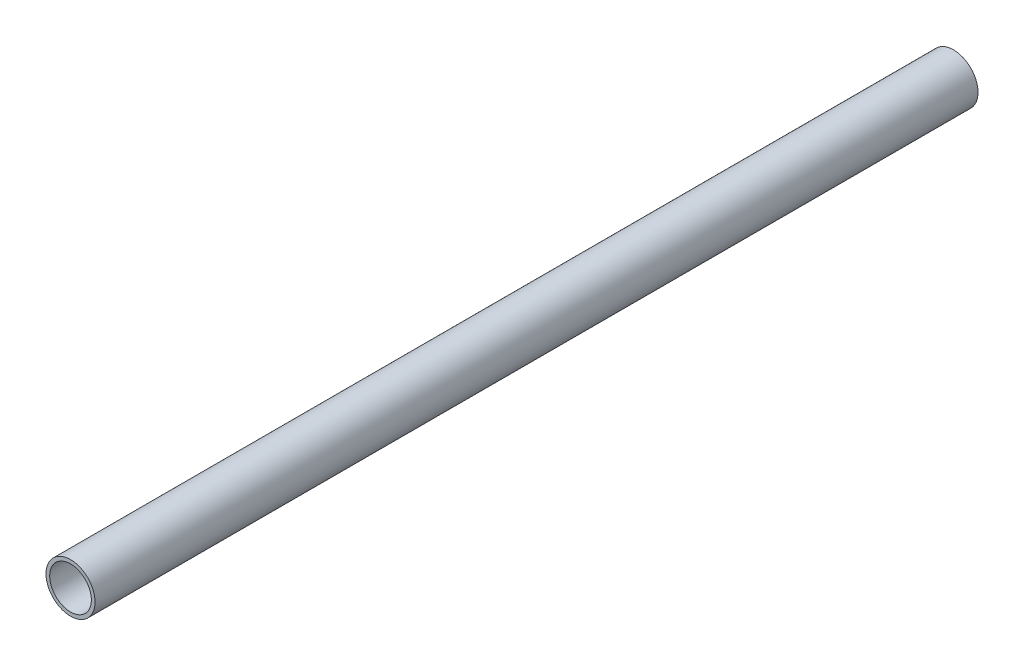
ISO-10303-21;
HEADER;
FILE_DESCRIPTION(('STEP AP214'),'2;1');
FILE_NAME('part.step','',(''),(''),'','','');
FILE_SCHEMA(('AUTOMOTIVE_DESIGN { 1 0 10303 214 1 1 1 1 }'));
ENDSEC;
DATA;
#1=APPLICATION_CONTEXT('core data for automotive mechanical design processes');
#2=APPLICATION_PROTOCOL_DEFINITION('international standard','automotive_design',2000,#1);
#3=PRODUCT_CONTEXT('',#1,'mechanical');
#4=PRODUCT('Part','Part','',(#3));
#5=PRODUCT_RELATED_PRODUCT_CATEGORY('part','',(#4));
#6=PRODUCT_DEFINITION_FORMATION('','',#4);
#7=PRODUCT_DEFINITION_CONTEXT('part definition',#1,'design');
#8=PRODUCT_DEFINITION('design','',#6,#7);
#9=PRODUCT_DEFINITION_SHAPE('','',#8);
#10=(LENGTH_UNIT() NAMED_UNIT(*) SI_UNIT(.MILLI.,.METRE.));
#11=(NAMED_UNIT(*) PLANE_ANGLE_UNIT() SI_UNIT($,.RADIAN.));
#12=(NAMED_UNIT(*) SI_UNIT($,.STERADIAN.) SOLID_ANGLE_UNIT());
#13=UNCERTAINTY_MEASURE_WITH_UNIT(LENGTH_MEASURE(1.E-05),#10,'distance_accuracy_value','');
#14=(GEOMETRIC_REPRESENTATION_CONTEXT(3) GLOBAL_UNCERTAINTY_ASSIGNED_CONTEXT((#13)) GLOBAL_UNIT_ASSIGNED_CONTEXT((#10,
#11,#12)) REPRESENTATION_CONTEXT('',''));
#15=CARTESIAN_POINT('',(0.,0.,0.));
#16=DIRECTION('',(0.,0.,1.));
#17=DIRECTION('',(1.,0.,0.));
#18=AXIS2_PLACEMENT_3D('',#15,#16,#17);
#19=CARTESIAN_POINT('',(0.,0.,0.));
#20=DIRECTION('',(0.,0.,1.));
#21=DIRECTION('',(1.,0.,0.));
#22=AXIS2_PLACEMENT_3D('',#19,#20,#21);
#23=PLANE('',#22);
#24=CARTESIAN_POINT('',(0.,0.,0.));
#25=DIRECTION('',(0.,0.,1.));
#26=DIRECTION('',(1.,0.,0.));
#27=AXIS2_PLACEMENT_3D('',#24,#25,#26);
#28=CIRCLE('',#27,10.);
#29=CARTESIAN_POINT('',(-10.,0.,0.));
#30=VERTEX_POINT('',#29);
#31=EDGE_CURVE('E35',#30,#30,#28,.T.);
#32=ORIENTED_EDGE('',*,*,#31,.F.);
#33=EDGE_LOOP('',(#32));
#34=FACE_BOUND('',#33,.T.);
#35=CARTESIAN_POINT('',(0.,0.,0.));
#36=DIRECTION('',(0.,0.,1.));
#37=DIRECTION('',(1.,0.,0.));
#38=AXIS2_PLACEMENT_3D('',#35,#36,#37);
#39=CIRCLE('',#38,8.5);
#40=CARTESIAN_POINT('',(-8.5,0.,0.));
#41=VERTEX_POINT('',#40);
#42=EDGE_CURVE('E43',#41,#41,#39,.T.);
#43=ORIENTED_EDGE('',*,*,#42,.T.);
#44=EDGE_LOOP('',(#43));
#45=FACE_BOUND('',#44,.T.);
#46=ADVANCED_FACE('F28',(#34,#45),#23,.F.);
#47=CARTESIAN_POINT('',(0.,0.,360.));
#48=DIRECTION('',(0.,0.,1.));
#49=DIRECTION('',(1.,0.,0.));
#50=AXIS2_PLACEMENT_3D('',#47,#48,#49);
#51=PLANE('',#50);
#52=CARTESIAN_POINT('',(0.,0.,360.));
#53=DIRECTION('',(0.,0.,1.));
#54=DIRECTION('',(1.,0.,0.));
#55=AXIS2_PLACEMENT_3D('',#52,#53,#54);
#56=CIRCLE('',#55,10.);
#57=CARTESIAN_POINT('',(-10.,0.,360.));
#58=VERTEX_POINT('',#57);
#59=EDGE_CURVE('E10',#58,#58,#56,.T.);
#60=ORIENTED_EDGE('',*,*,#59,.T.);
#61=EDGE_LOOP('',(#60));
#62=FACE_BOUND('',#61,.T.);
#63=CARTESIAN_POINT('',(0.,0.,360.));
#64=DIRECTION('',(0.,0.,1.));
#65=DIRECTION('',(1.,0.,0.));
#66=AXIS2_PLACEMENT_3D('',#63,#64,#65);
#67=CIRCLE('',#66,8.5);
#68=CARTESIAN_POINT('',(-8.5,0.,360.));
#69=VERTEX_POINT('',#68);
#70=EDGE_CURVE('E39',#69,#69,#67,.T.);
#71=ORIENTED_EDGE('',*,*,#70,.F.);
#72=EDGE_LOOP('',(#71));
#73=FACE_BOUND('',#72,.T.);
#74=ADVANCED_FACE('F57',(#62,#73),#51,.T.);
#75=CARTESIAN_POINT('',(0.,0.,360.));
#76=DIRECTION('',(0.,0.,-1.));
#77=DIRECTION('',(-1.,0.,0.));
#78=AXIS2_PLACEMENT_3D('',#75,#76,#77);
#79=CYLINDRICAL_SURFACE('',#78,10.);
#80=CARTESIAN_POINT('',(-10.,0.,360.));
#81=CARTESIAN_POINT('',(-10.,0.,356.25));
#82=CARTESIAN_POINT('',(-10.,0.,352.5));
#83=CARTESIAN_POINT('',(-10.,0.,345.));
#84=CARTESIAN_POINT('',(-10.,0.,341.25));
#85=CARTESIAN_POINT('',(-10.,0.,333.75));
#86=CARTESIAN_POINT('',(-10.,0.,330.));
#87=CARTESIAN_POINT('',(-10.,0.,322.5));
#88=CARTESIAN_POINT('',(-10.,0.,318.75));
#89=CARTESIAN_POINT('',(-10.,0.,311.25));
#90=CARTESIAN_POINT('',(-10.,0.,307.5));
#91=CARTESIAN_POINT('',(-10.,0.,300.));
#92=CARTESIAN_POINT('',(-10.,0.,296.25));
#93=CARTESIAN_POINT('',(-10.,0.,288.75));
#94=CARTESIAN_POINT('',(-10.,0.,285.));
#95=CARTESIAN_POINT('',(-10.,0.,277.5));
#96=CARTESIAN_POINT('',(-10.,0.,273.75));
#97=CARTESIAN_POINT('',(-10.,0.,266.25));
#98=CARTESIAN_POINT('',(-10.,0.,262.5));
#99=CARTESIAN_POINT('',(-10.,0.,255.));
#100=CARTESIAN_POINT('',(-10.,0.,251.25));
#101=CARTESIAN_POINT('',(-10.,0.,243.75));
#102=CARTESIAN_POINT('',(-10.,0.,240.));
#103=CARTESIAN_POINT('',(-10.,0.,232.5));
#104=CARTESIAN_POINT('',(-10.,0.,228.75));
#105=CARTESIAN_POINT('',(-10.,0.,221.25));
#106=CARTESIAN_POINT('',(-10.,0.,217.5));
#107=CARTESIAN_POINT('',(-10.,0.,210.));
#108=CARTESIAN_POINT('',(-10.,0.,206.25));
#109=CARTESIAN_POINT('',(-10.,0.,198.75));
#110=CARTESIAN_POINT('',(-10.,0.,195.));
#111=CARTESIAN_POINT('',(-10.,0.,187.5));
#112=CARTESIAN_POINT('',(-10.,0.,183.75));
#113=CARTESIAN_POINT('',(-10.,0.,176.25));
#114=CARTESIAN_POINT('',(-10.,0.,172.5));
#115=CARTESIAN_POINT('',(-10.,0.,165.));
#116=CARTESIAN_POINT('',(-10.,0.,161.25));
#117=CARTESIAN_POINT('',(-10.,0.,153.75));
#118=CARTESIAN_POINT('',(-10.,0.,150.));
#119=CARTESIAN_POINT('',(-10.,0.,142.5));
#120=CARTESIAN_POINT('',(-10.,0.,138.75));
#121=CARTESIAN_POINT('',(-10.,0.,131.25));
#122=CARTESIAN_POINT('',(-10.,0.,127.5));
#123=CARTESIAN_POINT('',(-10.,0.,120.));
#124=CARTESIAN_POINT('',(-10.,0.,116.25));
#125=CARTESIAN_POINT('',(-10.,0.,108.75));
#126=CARTESIAN_POINT('',(-10.,0.,105.));
#127=CARTESIAN_POINT('',(-10.,0.,97.5));
#128=CARTESIAN_POINT('',(-10.,0.,93.75));
#129=CARTESIAN_POINT('',(-10.,0.,86.25));
#130=CARTESIAN_POINT('',(-10.,0.,82.5));
#131=CARTESIAN_POINT('',(-10.,0.,75.));
#132=CARTESIAN_POINT('',(-10.,0.,71.25));
#133=CARTESIAN_POINT('',(-10.,0.,63.75));
#134=CARTESIAN_POINT('',(-10.,0.,60.));
#135=CARTESIAN_POINT('',(-10.,0.,52.5));
#136=CARTESIAN_POINT('',(-10.,0.,48.75));
#137=CARTESIAN_POINT('',(-10.,0.,41.25));
#138=CARTESIAN_POINT('',(-10.,0.,37.5));
#139=CARTESIAN_POINT('',(-10.,0.,30.));
#140=CARTESIAN_POINT('',(-10.,0.,26.25));
#141=CARTESIAN_POINT('',(-10.,0.,18.75));
#142=CARTESIAN_POINT('',(-10.,0.,14.9999999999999));
#143=CARTESIAN_POINT('',(-10.,0.,7.49999999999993));
#144=CARTESIAN_POINT('',(-10.,0.,3.74999999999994));
#145=CARTESIAN_POINT('',(-10.,0.,0.));
#146=B_SPLINE_CURVE_WITH_KNOTS('',3,(#80,#81,#82,#83,#84,#85,#86,#87,#88,#89,#90,#91,#92,#93,
#94,#95,#96,#97,#98,#99,#100,#101,#102,#103,#104,#105,#106,#107,#108,#109,#110,#111,#112,#113,
#114,#115,#116,#117,#118,#119,#120,#121,#122,#123,#124,#125,#126,#127,#128,#129,#130,#131,#132,
#133,#134,#135,#136,#137,#138,#139,#140,#141,#142,#143,#144,#145),.UNSPECIFIED.,.F.,.F.,(4,2,2,
2,2,2,2,2,2,2,2,2,2,2,2,2,2,2,2,2,2,2,2,2,2,2,2,2,2,2,2,2,4),(0.,11.25,22.5,33.7500000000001,
45.,56.25,67.5,78.75,90.,101.25,112.5,123.75,135.,146.25,157.5,168.75,180.,191.25,202.5,213.75,
225.,236.25,247.5,258.75,270.,281.25,292.5,303.75,315.,326.25,337.5,348.75,360.),.UNSPECIFIED.);
#147=EDGE_CURVE('BSEAM30',#58,#30,#146,.T.);
#148=ORIENTED_EDGE('',*,*,#59,.F.);
#149=ORIENTED_EDGE('',*,*,#31,.T.);
#150=ORIENTED_EDGE('',*,*,#147,.T.);
#151=ORIENTED_EDGE('',*,*,#147,.F.);
#152=EDGE_LOOP('',(#148,#150,#149,#151));
#153=FACE_BOUND('',#152,.T.);
#154=ADVANCED_FACE('F30',(#153),#79,.T.);
#155=CARTESIAN_POINT('',(0.,0.,360.));
#156=DIRECTION('',(0.,0.,-1.));
#157=DIRECTION('',(-1.,0.,0.));
#158=AXIS2_PLACEMENT_3D('',#155,#156,#157);
#159=CYLINDRICAL_SURFACE('',#158,8.5);
#160=CARTESIAN_POINT('',(-8.5,0.,360.));
#161=CARTESIAN_POINT('',(-8.5,0.,356.25));
#162=CARTESIAN_POINT('',(-8.5,0.,352.5));
#163=CARTESIAN_POINT('',(-8.5,0.,345.));
#164=CARTESIAN_POINT('',(-8.5,0.,341.25));
#165=CARTESIAN_POINT('',(-8.5,0.,333.75));
#166=CARTESIAN_POINT('',(-8.5,0.,330.));
#167=CARTESIAN_POINT('',(-8.5,0.,322.5));
#168=CARTESIAN_POINT('',(-8.5,0.,318.75));
#169=CARTESIAN_POINT('',(-8.5,0.,311.25));
#170=CARTESIAN_POINT('',(-8.5,0.,307.5));
#171=CARTESIAN_POINT('',(-8.5,0.,300.));
#172=CARTESIAN_POINT('',(-8.5,0.,296.25));
#173=CARTESIAN_POINT('',(-8.5,0.,288.75));
#174=CARTESIAN_POINT('',(-8.5,0.,285.));
#175=CARTESIAN_POINT('',(-8.5,0.,277.5));
#176=CARTESIAN_POINT('',(-8.5,0.,273.75));
#177=CARTESIAN_POINT('',(-8.5,0.,266.25));
#178=CARTESIAN_POINT('',(-8.5,0.,262.5));
#179=CARTESIAN_POINT('',(-8.5,0.,255.));
#180=CARTESIAN_POINT('',(-8.5,0.,251.25));
#181=CARTESIAN_POINT('',(-8.5,0.,243.75));
#182=CARTESIAN_POINT('',(-8.5,0.,240.));
#183=CARTESIAN_POINT('',(-8.5,0.,232.5));
#184=CARTESIAN_POINT('',(-8.5,0.,228.75));
#185=CARTESIAN_POINT('',(-8.5,0.,221.25));
#186=CARTESIAN_POINT('',(-8.5,0.,217.5));
#187=CARTESIAN_POINT('',(-8.5,0.,210.));
#188=CARTESIAN_POINT('',(-8.5,0.,206.25));
#189=CARTESIAN_POINT('',(-8.5,0.,198.75));
#190=CARTESIAN_POINT('',(-8.5,0.,195.));
#191=CARTESIAN_POINT('',(-8.5,0.,187.5));
#192=CARTESIAN_POINT('',(-8.5,0.,183.75));
#193=CARTESIAN_POINT('',(-8.5,0.,176.25));
#194=CARTESIAN_POINT('',(-8.5,0.,172.5));
#195=CARTESIAN_POINT('',(-8.5,0.,165.));
#196=CARTESIAN_POINT('',(-8.5,0.,161.25));
#197=CARTESIAN_POINT('',(-8.5,0.,153.75));
#198=CARTESIAN_POINT('',(-8.5,0.,150.));
#199=CARTESIAN_POINT('',(-8.5,0.,142.5));
#200=CARTESIAN_POINT('',(-8.5,0.,138.75));
#201=CARTESIAN_POINT('',(-8.5,0.,131.25));
#202=CARTESIAN_POINT('',(-8.5,0.,127.5));
#203=CARTESIAN_POINT('',(-8.5,0.,120.));
#204=CARTESIAN_POINT('',(-8.5,0.,116.25));
#205=CARTESIAN_POINT('',(-8.5,0.,108.75));
#206=CARTESIAN_POINT('',(-8.5,0.,105.));
#207=CARTESIAN_POINT('',(-8.5,0.,97.5));
#208=CARTESIAN_POINT('',(-8.5,0.,93.75));
#209=CARTESIAN_POINT('',(-8.5,0.,86.25));
#210=CARTESIAN_POINT('',(-8.5,0.,82.4999999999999));
#211=CARTESIAN_POINT('',(-8.5,0.,74.9999999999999));
#212=CARTESIAN_POINT('',(-8.5,0.,71.2499999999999));
#213=CARTESIAN_POINT('',(-8.5,0.,63.75));
#214=CARTESIAN_POINT('',(-8.5,0.,60.));
#215=CARTESIAN_POINT('',(-8.5,0.,52.5));
#216=CARTESIAN_POINT('',(-8.5,0.,48.7499999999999));
#217=CARTESIAN_POINT('',(-8.5,0.,41.2499999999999));
#218=CARTESIAN_POINT('',(-8.5,0.,37.4999999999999));
#219=CARTESIAN_POINT('',(-8.5,0.,30.));
#220=CARTESIAN_POINT('',(-8.5,0.,26.25));
#221=CARTESIAN_POINT('',(-8.5,0.,18.75));
#222=CARTESIAN_POINT('',(-8.5,0.,14.9999999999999));
#223=CARTESIAN_POINT('',(-8.5,0.,7.49999999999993));
#224=CARTESIAN_POINT('',(-8.5,0.,3.74999999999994));
#225=CARTESIAN_POINT('',(-8.5,0.,0.));
#226=B_SPLINE_CURVE_WITH_KNOTS('',3,(#160,#161,#162,#163,#164,#165,#166,#167,#168,#169,#170,
#171,#172,#173,#174,#175,#176,#177,#178,#179,#180,#181,#182,#183,#184,#185,#186,#187,#188,#189,
#190,#191,#192,#193,#194,#195,#196,#197,#198,#199,#200,#201,#202,#203,#204,#205,#206,#207,#208,
#209,#210,#211,#212,#213,#214,#215,#216,#217,#218,#219,#220,#221,#222,#223,#224,#225),
.UNSPECIFIED.,.F.,.F.,(4,2,2,2,2,2,2,2,2,2,2,2,2,2,2,2,2,2,2,2,2,2,2,2,2,2,2,2,2,2,2,2,4),(0.,
11.25,22.5,33.7499999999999,45.,56.25,67.4999999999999,78.75,90.,101.25,112.5,123.75,135.,
146.25,157.5,168.75,180.,191.25,202.5,213.75,225.,236.25,247.5,258.75,270.,281.25,292.5,303.75,
315.,326.25,337.5,348.75,360.),.UNSPECIFIED.);
#227=EDGE_CURVE('BSEAM50',#69,#41,#226,.T.);
#228=ORIENTED_EDGE('',*,*,#70,.T.);
#229=ORIENTED_EDGE('',*,*,#42,.F.);
#230=ORIENTED_EDGE('',*,*,#227,.T.);
#231=ORIENTED_EDGE('',*,*,#227,.F.);
#232=EDGE_LOOP('',(#228,#230,#229,#231));
#233=FACE_BOUND('',#232,.T.);
#234=ADVANCED_FACE('F50',(#233),#159,.F.);
#235=CLOSED_SHELL('',(#46,#74,#154,#234));
#236=MANIFOLD_SOLID_BREP('B2',#235);
#237=ADVANCED_BREP_SHAPE_REPRESENTATION('',(#18,#236),#14);
#238=SHAPE_DEFINITION_REPRESENTATION(#9,#237);
ENDSEC;
END-ISO-10303-21;
